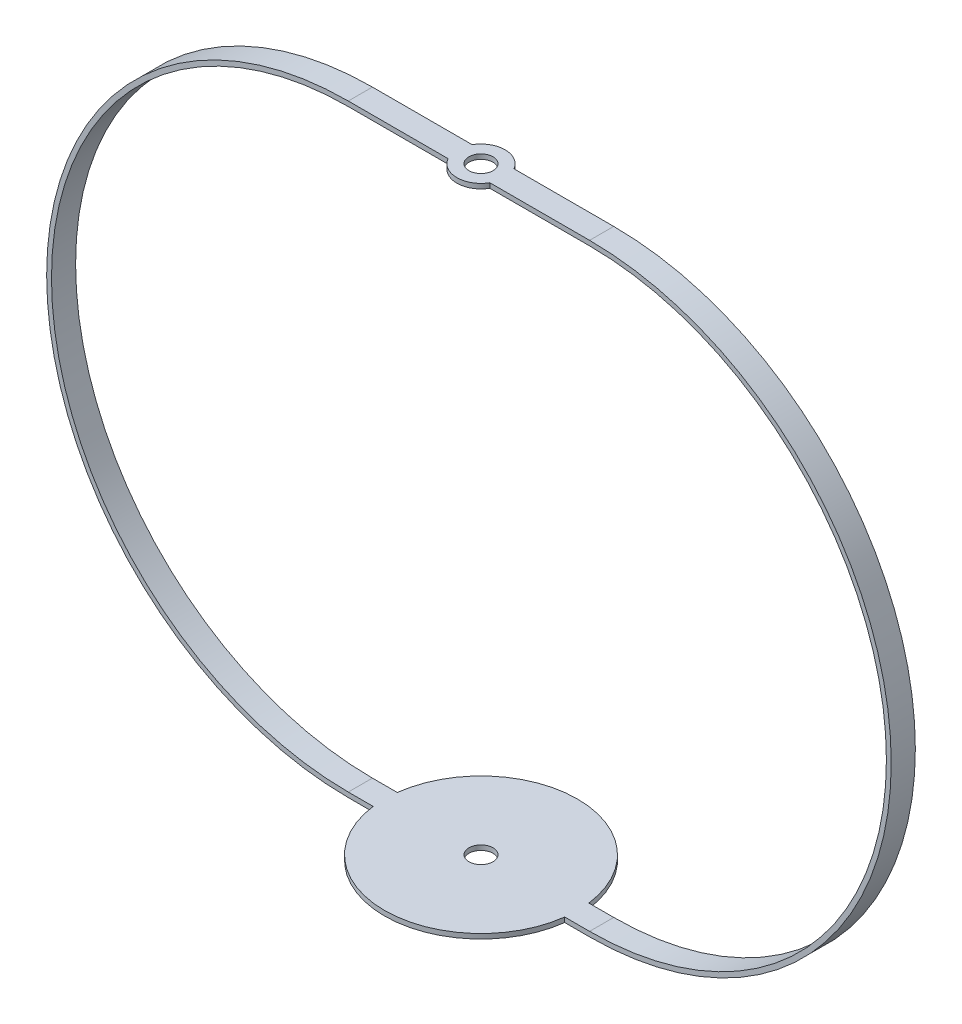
ISO-10303-21;
HEADER;
FILE_DESCRIPTION(('STEP AP214'),'2;1');
FILE_NAME('part.step','',(''),(''),'','','');
FILE_SCHEMA(('AUTOMOTIVE_DESIGN { 1 0 10303 214 1 1 1 1 }'));
ENDSEC;
DATA;
#1=APPLICATION_CONTEXT('core data for automotive mechanical design processes');
#2=APPLICATION_PROTOCOL_DEFINITION('international standard','automotive_design',2000,#1);
#3=PRODUCT_CONTEXT('',#1,'mechanical');
#4=PRODUCT('Part','Part','',(#3));
#5=PRODUCT_RELATED_PRODUCT_CATEGORY('part','',(#4));
#6=PRODUCT_DEFINITION_FORMATION('','',#4);
#7=PRODUCT_DEFINITION_CONTEXT('part definition',#1,'design');
#8=PRODUCT_DEFINITION('design','',#6,#7);
#9=PRODUCT_DEFINITION_SHAPE('','',#8);
#10=(LENGTH_UNIT() NAMED_UNIT(*) SI_UNIT(.MILLI.,.METRE.));
#11=(NAMED_UNIT(*) PLANE_ANGLE_UNIT() SI_UNIT($,.RADIAN.));
#12=(NAMED_UNIT(*) SI_UNIT($,.STERADIAN.) SOLID_ANGLE_UNIT());
#13=UNCERTAINTY_MEASURE_WITH_UNIT(LENGTH_MEASURE(1.E-05),#10,'distance_accuracy_value','');
#14=(GEOMETRIC_REPRESENTATION_CONTEXT(3) GLOBAL_UNCERTAINTY_ASSIGNED_CONTEXT((#13)) GLOBAL_UNIT_ASSIGNED_CONTEXT((#10,
#11,#12)) REPRESENTATION_CONTEXT('',''));
#15=CARTESIAN_POINT('',(0.,0.,0.));
#16=DIRECTION('',(0.,0.,1.));
#17=DIRECTION('',(1.,0.,0.));
#18=AXIS2_PLACEMENT_3D('',#15,#16,#17);
#19=CARTESIAN_POINT('',(0.,0.,5.));
#20=DIRECTION('',(0.,0.,1.));
#21=DIRECTION('',(1.,0.,0.));
#22=AXIS2_PLACEMENT_3D('',#19,#20,#21);
#23=PLANE('',#22);
#24=DIRECTION('',(0.,1.,0.));
#25=VECTOR('',#24,1.);
#26=CARTESIAN_POINT('',(84.6624945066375,0.,5.));
#27=LINE('',#26,#25);
#28=CARTESIAN_POINT('',(84.6624945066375,0.,5.));
#29=VERTEX_POINT('',#28);
#30=CARTESIAN_POINT('',(84.6624945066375,2.,5.));
#31=VERTEX_POINT('',#30);
#32=EDGE_CURVE('E243',#29,#31,#27,.T.);
#33=ORIENTED_EDGE('',*,*,#32,.F.);
#34=DIRECTION('',(1.,0.,0.));
#35=VECTOR('',#34,1.);
#36=CARTESIAN_POINT('',(0.,0.,5.));
#37=LINE('',#36,#35);
#38=CARTESIAN_POINT('',(94.9762248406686,0.,5.));
#39=VERTEX_POINT('',#38);
#40=EDGE_CURVE('E400',#29,#39,#37,.T.);
#41=ORIENTED_EDGE('',*,*,#40,.T.);
#42=CARTESIAN_POINT('',(94.9762248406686,125.,5.));
#43=DIRECTION('',(0.,0.,-1.));
#44=DIRECTION('',(-1.,0.,0.));
#45=AXIS2_PLACEMENT_3D('',#42,#43,#44);
#46=CIRCLE('',#45,125.);
#47=CARTESIAN_POINT('',(94.9762248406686,250.,5.));
#48=VERTEX_POINT('',#47);
#49=EDGE_CURVE('E419',#48,#39,#46,.T.);
#50=ORIENTED_EDGE('',*,*,#49,.F.);
#51=DIRECTION('',(1.,0.,0.));
#52=VECTOR('',#51,1.);
#53=CARTESIAN_POINT('',(0.,250.,5.));
#54=LINE('',#53,#52);
#55=CARTESIAN_POINT('',(53.636478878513,250.,5.));
#56=VERTEX_POINT('',#55);
#57=EDGE_CURVE('E445',#56,#48,#54,.T.);
#58=ORIENTED_EDGE('',*,*,#57,.F.);
#59=DIRECTION('',(0.,1.,0.));
#60=VECTOR('',#59,1.);
#61=CARTESIAN_POINT('',(53.636478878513,248.,5.));
#62=LINE('',#61,#60);
#63=CARTESIAN_POINT('',(53.636478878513,248.,5.));
#64=VERTEX_POINT('',#63);
#65=EDGE_CURVE('E401',#64,#56,#62,.T.);
#66=ORIENTED_EDGE('',*,*,#65,.F.);
#67=DIRECTION('',(-1.,0.,0.));
#68=VECTOR('',#67,1.);
#69=CARTESIAN_POINT('',(0.,248.,5.));
#70=LINE('',#69,#68);
#71=CARTESIAN_POINT('',(94.9762248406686,248.,5.));
#72=VERTEX_POINT('',#71);
#73=EDGE_CURVE('E442',#72,#64,#70,.T.);
#74=ORIENTED_EDGE('',*,*,#73,.F.);
#75=CARTESIAN_POINT('',(94.9762248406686,125.,5.));
#76=DIRECTION('',(0.,0.,-1.));
#77=DIRECTION('',(-1.,0.,0.));
#78=AXIS2_PLACEMENT_3D('',#75,#76,#77);
#79=CIRCLE('',#78,123.);
#80=CARTESIAN_POINT('',(94.9762248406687,2.,5.));
#81=VERTEX_POINT('',#80);
#82=EDGE_CURVE('E416',#72,#81,#79,.T.);
#83=ORIENTED_EDGE('',*,*,#82,.T.);
#84=DIRECTION('',(-1.,0.,0.));
#85=VECTOR('',#84,1.);
#86=CARTESIAN_POINT('',(0.,2.,5.));
#87=LINE('',#86,#85);
#88=EDGE_CURVE('E369',#81,#31,#87,.T.);
#89=ORIENTED_EDGE('',*,*,#88,.T.);
#90=EDGE_LOOP('',(#33,#41,#50,#58,#66,#74,#83,#89));
#91=FACE_BOUND('',#90,.T.);
#92=ADVANCED_FACE('F227',(#91),#23,.T.);
#93=CARTESIAN_POINT('',(0.,0.,-5.));
#94=DIRECTION('',(0.,0.,1.));
#95=DIRECTION('',(1.,0.,0.));
#96=AXIS2_PLACEMENT_3D('',#93,#94,#95);
#97=PLANE('',#96);
#98=DIRECTION('',(1.,0.,0.));
#99=VECTOR('',#98,1.);
#100=CARTESIAN_POINT('',(0.,0.,-5.));
#101=LINE('',#100,#99);
#102=CARTESIAN_POINT('',(84.6624945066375,0.,-5.));
#103=VERTEX_POINT('',#102);
#104=CARTESIAN_POINT('',(94.9762248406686,0.,-5.));
#105=VERTEX_POINT('',#104);
#106=EDGE_CURVE('E359',#103,#105,#101,.T.);
#107=ORIENTED_EDGE('',*,*,#106,.F.);
#108=DIRECTION('',(0.,1.,0.));
#109=VECTOR('',#108,1.);
#110=CARTESIAN_POINT('',(84.6624945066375,0.,-5.));
#111=LINE('',#110,#109);
#112=CARTESIAN_POINT('',(84.6624945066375,2.,-5.));
#113=VERTEX_POINT('',#112);
#114=EDGE_CURVE('E342',#103,#113,#111,.T.);
#115=ORIENTED_EDGE('',*,*,#114,.T.);
#116=DIRECTION('',(-1.,0.,0.));
#117=VECTOR('',#116,1.);
#118=CARTESIAN_POINT('',(0.,2.,-5.));
#119=LINE('',#118,#117);
#120=CARTESIAN_POINT('',(94.9762248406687,2.,-5.));
#121=VERTEX_POINT('',#120);
#122=EDGE_CURVE('E376',#121,#113,#119,.T.);
#123=ORIENTED_EDGE('',*,*,#122,.F.);
#124=CARTESIAN_POINT('',(94.9762248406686,125.,-5.));
#125=DIRECTION('',(0.,0.,-1.));
#126=DIRECTION('',(-1.,0.,0.));
#127=AXIS2_PLACEMENT_3D('',#124,#125,#126);
#128=CIRCLE('',#127,123.);
#129=CARTESIAN_POINT('',(94.9762248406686,248.,-5.));
#130=VERTEX_POINT('',#129);
#131=EDGE_CURVE('E378',#130,#121,#128,.T.);
#132=ORIENTED_EDGE('',*,*,#131,.F.);
#133=DIRECTION('',(-1.,0.,0.));
#134=VECTOR('',#133,1.);
#135=CARTESIAN_POINT('',(0.,248.,-5.));
#136=LINE('',#135,#134);
#137=CARTESIAN_POINT('',(53.636478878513,248.,-5.));
#138=VERTEX_POINT('',#137);
#139=EDGE_CURVE('E449',#130,#138,#136,.T.);
#140=ORIENTED_EDGE('',*,*,#139,.T.);
#141=DIRECTION('',(0.,1.,0.));
#142=VECTOR('',#141,1.);
#143=CARTESIAN_POINT('',(53.636478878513,248.,-5.));
#144=LINE('',#143,#142);
#145=CARTESIAN_POINT('',(53.636478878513,250.,-5.));
#146=VERTEX_POINT('',#145);
#147=EDGE_CURVE('E12',#138,#146,#144,.T.);
#148=ORIENTED_EDGE('',*,*,#147,.T.);
#149=DIRECTION('',(1.,0.,0.));
#150=VECTOR('',#149,1.);
#151=CARTESIAN_POINT('',(0.,250.,-5.));
#152=LINE('',#151,#150);
#153=CARTESIAN_POINT('',(94.9762248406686,250.,-5.));
#154=VERTEX_POINT('',#153);
#155=EDGE_CURVE('E450',#146,#154,#152,.T.);
#156=ORIENTED_EDGE('',*,*,#155,.T.);
#157=CARTESIAN_POINT('',(94.9762248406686,125.,-5.));
#158=DIRECTION('',(0.,0.,-1.));
#159=DIRECTION('',(-1.,0.,0.));
#160=AXIS2_PLACEMENT_3D('',#157,#158,#159);
#161=CIRCLE('',#160,125.);
#162=EDGE_CURVE('E368',#154,#105,#161,.T.);
#163=ORIENTED_EDGE('',*,*,#162,.T.);
#164=EDGE_LOOP('',(#107,#115,#123,#132,#140,#148,#156,#163));
#165=FACE_BOUND('',#164,.T.);
#166=ADVANCED_FACE('F366',(#165),#97,.F.);
#167=DIRECTION('',(0.,1.,0.));
#168=VECTOR('',#167,1.);
#169=CARTESIAN_POINT('',(5.28995517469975,0.,5.));
#170=LINE('',#169,#168);
#171=CARTESIAN_POINT('',(5.28995517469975,2.,5.));
#172=VERTEX_POINT('',#171);
#173=CARTESIAN_POINT('',(5.28995517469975,0.,5.));
#174=VERTEX_POINT('',#173);
#175=EDGE_CURVE('E353',#172,#174,#170,.F.);
#176=ORIENTED_EDGE('',*,*,#175,.F.);
#177=CARTESIAN_POINT('',(-5.0237751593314,2.,5.));
#178=VERTEX_POINT('',#177);
#179=EDGE_CURVE('E372',#172,#178,#87,.T.);
#180=ORIENTED_EDGE('',*,*,#179,.T.);
#181=CARTESIAN_POINT('',(-5.02377515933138,125.,5.));
#182=DIRECTION('',(0.,0.,1.));
#183=DIRECTION('',(1.,0.,0.));
#184=AXIS2_PLACEMENT_3D('',#181,#182,#183);
#185=CIRCLE('',#184,123.);
#186=CARTESIAN_POINT('',(-5.02377515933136,248.,5.));
#187=VERTEX_POINT('',#186);
#188=EDGE_CURVE('E432',#187,#178,#185,.T.);
#189=ORIENTED_EDGE('',*,*,#188,.F.);
#190=CARTESIAN_POINT('',(36.3159708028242,248.,5.));
#191=VERTEX_POINT('',#190);
#192=EDGE_CURVE('E439',#191,#187,#70,.T.);
#193=ORIENTED_EDGE('',*,*,#192,.F.);
#194=DIRECTION('',(0.,1.,0.));
#195=VECTOR('',#194,1.);
#196=CARTESIAN_POINT('',(36.3159708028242,248.,5.));
#197=LINE('',#196,#195);
#198=CARTESIAN_POINT('',(36.3159708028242,250.,5.));
#199=VERTEX_POINT('',#198);
#200=EDGE_CURVE('E404',#199,#191,#197,.F.);
#201=ORIENTED_EDGE('',*,*,#200,.F.);
#202=CARTESIAN_POINT('',(-5.02377515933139,250.,5.));
#203=VERTEX_POINT('',#202);
#204=EDGE_CURVE('E446',#203,#199,#54,.T.);
#205=ORIENTED_EDGE('',*,*,#204,.F.);
#206=CARTESIAN_POINT('',(-5.02377515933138,125.,5.));
#207=DIRECTION('',(0.,0.,1.));
#208=DIRECTION('',(1.,0.,0.));
#209=AXIS2_PLACEMENT_3D('',#206,#207,#208);
#210=CIRCLE('',#209,125.);
#211=CARTESIAN_POINT('',(-5.02377515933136,0.,5.));
#212=VERTEX_POINT('',#211);
#213=EDGE_CURVE('E434',#203,#212,#210,.T.);
#214=ORIENTED_EDGE('',*,*,#213,.T.);
#215=EDGE_CURVE('E251',#212,#174,#37,.T.);
#216=ORIENTED_EDGE('',*,*,#215,.T.);
#217=EDGE_LOOP('',(#176,#180,#189,#193,#201,#205,#214,#216));
#218=FACE_BOUND('',#217,.T.);
#219=ADVANCED_FACE('F466',(#218),#23,.T.);
#220=CARTESIAN_POINT('',(94.9762248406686,125.,5.));
#221=DIRECTION('',(0.,0.,-1.));
#222=DIRECTION('',(-1.,0.,0.));
#223=AXIS2_PLACEMENT_3D('',#220,#221,#222);
#224=CYLINDRICAL_SURFACE('',#223,123.);
#225=ORIENTED_EDGE('',*,*,#82,.F.);
#226=DIRECTION('',(0.,0.,1.));
#227=VECTOR('',#226,1.);
#228=CARTESIAN_POINT('',(94.9762248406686,248.,-5.));
#229=LINE('',#228,#227);
#230=EDGE_CURVE('E399',#130,#72,#229,.T.);
#231=ORIENTED_EDGE('',*,*,#230,.F.);
#232=ORIENTED_EDGE('',*,*,#131,.T.);
#233=DIRECTION('',(0.,0.,-1.));
#234=VECTOR('',#233,1.);
#235=CARTESIAN_POINT('',(94.9762248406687,2.,5.));
#236=LINE('',#235,#234);
#237=EDGE_CURVE('E424',#81,#121,#236,.T.);
#238=ORIENTED_EDGE('',*,*,#237,.F.);
#239=EDGE_LOOP('',(#225,#231,#232,#238));
#240=FACE_BOUND('',#239,.T.);
#241=ADVANCED_FACE('F492',(#240),#224,.F.);
#242=CARTESIAN_POINT('',(94.9762248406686,125.,5.));
#243=DIRECTION('',(0.,0.,-1.));
#244=DIRECTION('',(-1.,0.,0.));
#245=AXIS2_PLACEMENT_3D('',#242,#243,#244);
#246=CYLINDRICAL_SURFACE('',#245,125.);
#247=DIRECTION('',(0.,0.,-1.));
#248=VECTOR('',#247,1.);
#249=CARTESIAN_POINT('',(94.9762248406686,0.,5.));
#250=LINE('',#249,#248);
#251=EDGE_CURVE('E422',#39,#105,#250,.T.);
#252=ORIENTED_EDGE('',*,*,#251,.T.);
#253=ORIENTED_EDGE('',*,*,#162,.F.);
#254=DIRECTION('',(0.,0.,1.));
#255=VECTOR('',#254,1.);
#256=CARTESIAN_POINT('',(94.9762248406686,250.,-5.));
#257=LINE('',#256,#255);
#258=EDGE_CURVE('E391',#154,#48,#257,.T.);
#259=ORIENTED_EDGE('',*,*,#258,.T.);
#260=ORIENTED_EDGE('',*,*,#49,.T.);
#261=EDGE_LOOP('',(#252,#253,#259,#260));
#262=FACE_BOUND('',#261,.T.);
#263=ADVANCED_FACE('F495',(#262),#246,.T.);
#264=CARTESIAN_POINT('',(0.,250.,-5.));
#265=DIRECTION('',(0.,-1.,0.));
#266=DIRECTION('',(0.,0.,-1.));
#267=AXIS2_PLACEMENT_3D('',#264,#265,#266);
#268=PLANE('',#267);
#269=CARTESIAN_POINT('',(44.9762248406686,250.,0.));
#270=DIRECTION('',(0.,1.,0.));
#271=DIRECTION('',(0.,0.,1.));
#272=AXIS2_PLACEMENT_3D('',#269,#270,#271);
#273=CIRCLE('',#272,5.);
#274=CARTESIAN_POINT('',(44.9762248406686,250.,5.));
#275=VERTEX_POINT('',#274);
#276=EDGE_CURVE('E504',#275,#275,#273,.T.);
#277=ORIENTED_EDGE('',*,*,#276,.F.);
#278=EDGE_LOOP('',(#277));
#279=FACE_BOUND('',#278,.T.);
#280=ORIENTED_EDGE('',*,*,#204,.T.);
#281=CARTESIAN_POINT('',(44.9762248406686,250.,0.));
#282=DIRECTION('',(0.,1.,0.));
#283=DIRECTION('',(0.,0.,1.));
#284=AXIS2_PLACEMENT_3D('',#281,#282,#283);
#285=CIRCLE('',#284,10.);
#286=EDGE_CURVE('E479',#199,#56,#285,.T.);
#287=ORIENTED_EDGE('',*,*,#286,.T.);
#288=ORIENTED_EDGE('',*,*,#57,.T.);
#289=ORIENTED_EDGE('',*,*,#258,.F.);
#290=ORIENTED_EDGE('',*,*,#155,.F.);
#291=CARTESIAN_POINT('',(36.3159708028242,250.,-5.));
#292=VERTEX_POINT('',#291);
#293=EDGE_CURVE('E480',#146,#292,#285,.T.);
#294=ORIENTED_EDGE('',*,*,#293,.T.);
#295=CARTESIAN_POINT('',(-5.0237751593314,250.,-5.));
#296=VERTEX_POINT('',#295);
#297=EDGE_CURVE('E394',#296,#292,#152,.T.);
#298=ORIENTED_EDGE('',*,*,#297,.F.);
#299=DIRECTION('',(0.,0.,1.));
#300=VECTOR('',#299,1.);
#301=CARTESIAN_POINT('',(-5.02377515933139,250.,-5.));
#302=LINE('',#301,#300);
#303=EDGE_CURVE('E384',#296,#203,#302,.T.);
#304=ORIENTED_EDGE('',*,*,#303,.T.);
#305=EDGE_LOOP('',(#280,#287,#288,#289,#290,#294,#298,#304));
#306=FACE_BOUND('',#305,.T.);
#307=ADVANCED_FACE('F485',(#279,#306),#268,.F.);
#308=CARTESIAN_POINT('',(-5.02377515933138,125.,5.));
#309=DIRECTION('',(0.,0.,-1.));
#310=DIRECTION('',(-1.,0.,0.));
#311=AXIS2_PLACEMENT_3D('',#308,#309,#310);
#312=CYLINDRICAL_SURFACE('',#311,125.);
#313=ORIENTED_EDGE('',*,*,#213,.F.);
#314=ORIENTED_EDGE('',*,*,#303,.F.);
#315=CARTESIAN_POINT('',(-5.02377515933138,125.,-5.));
#316=DIRECTION('',(0.,0.,1.));
#317=DIRECTION('',(1.,0.,0.));
#318=AXIS2_PLACEMENT_3D('',#315,#316,#317);
#319=CIRCLE('',#318,125.);
#320=CARTESIAN_POINT('',(-5.02377515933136,0.,-5.));
#321=VERTEX_POINT('',#320);
#322=EDGE_CURVE('E429',#296,#321,#319,.T.);
#323=ORIENTED_EDGE('',*,*,#322,.T.);
#324=DIRECTION('',(0.,0.,-1.));
#325=VECTOR('',#324,1.);
#326=CARTESIAN_POINT('',(-5.02377515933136,0.,5.));
#327=LINE('',#326,#325);
#328=EDGE_CURVE('E437',#212,#321,#327,.T.);
#329=ORIENTED_EDGE('',*,*,#328,.F.);
#330=EDGE_LOOP('',(#313,#314,#323,#329));
#331=FACE_BOUND('',#330,.T.);
#332=ADVANCED_FACE('F543',(#331),#312,.T.);
#333=CARTESIAN_POINT('',(-5.02377515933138,125.,5.));
#334=DIRECTION('',(0.,0.,-1.));
#335=DIRECTION('',(-1.,0.,0.));
#336=AXIS2_PLACEMENT_3D('',#333,#334,#335);
#337=CYLINDRICAL_SURFACE('',#336,123.);
#338=DIRECTION('',(0.,0.,-1.));
#339=VECTOR('',#338,1.);
#340=CARTESIAN_POINT('',(-5.0237751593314,2.,5.));
#341=LINE('',#340,#339);
#342=CARTESIAN_POINT('',(-5.0237751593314,2.,-5.));
#343=VERTEX_POINT('',#342);
#344=EDGE_CURVE('E436',#178,#343,#341,.T.);
#345=ORIENTED_EDGE('',*,*,#344,.T.);
#346=CARTESIAN_POINT('',(-5.02377515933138,125.,-5.));
#347=DIRECTION('',(0.,0.,1.));
#348=DIRECTION('',(1.,0.,0.));
#349=AXIS2_PLACEMENT_3D('',#346,#347,#348);
#350=CIRCLE('',#349,123.);
#351=CARTESIAN_POINT('',(-5.02377515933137,248.,-5.));
#352=VERTEX_POINT('',#351);
#353=EDGE_CURVE('E426',#352,#343,#350,.T.);
#354=ORIENTED_EDGE('',*,*,#353,.F.);
#355=DIRECTION('',(0.,0.,1.));
#356=VECTOR('',#355,1.);
#357=CARTESIAN_POINT('',(-5.02377515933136,248.,-5.));
#358=LINE('',#357,#356);
#359=EDGE_CURVE('E379',#352,#187,#358,.T.);
#360=ORIENTED_EDGE('',*,*,#359,.T.);
#361=ORIENTED_EDGE('',*,*,#188,.T.);
#362=EDGE_LOOP('',(#345,#354,#360,#361));
#363=FACE_BOUND('',#362,.T.);
#364=ADVANCED_FACE('F459',(#363),#337,.F.);
#365=CARTESIAN_POINT('',(0.,248.,-5.));
#366=DIRECTION('',(0.,1.,0.));
#367=DIRECTION('',(0.,0.,1.));
#368=AXIS2_PLACEMENT_3D('',#365,#366,#367);
#369=PLANE('',#368);
#370=CARTESIAN_POINT('',(44.9762248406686,248.,0.));
#371=DIRECTION('',(0.,1.,0.));
#372=DIRECTION('',(0.,0.,1.));
#373=AXIS2_PLACEMENT_3D('',#370,#371,#372);
#374=CIRCLE('',#373,5.);
#375=CARTESIAN_POINT('',(44.9762248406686,248.,5.));
#376=VERTEX_POINT('',#375);
#377=EDGE_CURVE('E501',#376,#376,#374,.T.);
#378=ORIENTED_EDGE('',*,*,#377,.T.);
#379=EDGE_LOOP('',(#378));
#380=FACE_BOUND('',#379,.T.);
#381=CARTESIAN_POINT('',(36.3159708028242,248.,-5.));
#382=VERTEX_POINT('',#381);
#383=EDGE_CURVE('E448',#382,#352,#136,.T.);
#384=ORIENTED_EDGE('',*,*,#383,.F.);
#385=CARTESIAN_POINT('',(44.9762248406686,248.,0.));
#386=DIRECTION('',(0.,1.,0.));
#387=DIRECTION('',(0.,0.,1.));
#388=AXIS2_PLACEMENT_3D('',#385,#386,#387);
#389=CIRCLE('',#388,10.);
#390=EDGE_CURVE('E409',#138,#382,#389,.T.);
#391=ORIENTED_EDGE('',*,*,#390,.F.);
#392=ORIENTED_EDGE('',*,*,#139,.F.);
#393=ORIENTED_EDGE('',*,*,#230,.T.);
#394=ORIENTED_EDGE('',*,*,#73,.T.);
#395=EDGE_CURVE('E464',#191,#64,#389,.T.);
#396=ORIENTED_EDGE('',*,*,#395,.F.);
#397=ORIENTED_EDGE('',*,*,#192,.T.);
#398=ORIENTED_EDGE('',*,*,#359,.F.);
#399=EDGE_LOOP('',(#384,#391,#392,#393,#394,#396,#397,#398));
#400=FACE_BOUND('',#399,.T.);
#401=ADVANCED_FACE('F461',(#380,#400),#369,.F.);
#402=CARTESIAN_POINT('',(5.28995517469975,2.,-5.));
#403=VERTEX_POINT('',#402);
#404=EDGE_CURVE('E371',#403,#343,#119,.T.);
#405=ORIENTED_EDGE('',*,*,#404,.F.);
#406=DIRECTION('',(0.,1.,0.));
#407=VECTOR('',#406,1.);
#408=CARTESIAN_POINT('',(5.28995517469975,0.,-5.));
#409=LINE('',#408,#407);
#410=CARTESIAN_POINT('',(5.28995517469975,0.,-5.));
#411=VERTEX_POINT('',#410);
#412=EDGE_CURVE('E354',#403,#411,#409,.F.);
#413=ORIENTED_EDGE('',*,*,#412,.T.);
#414=EDGE_CURVE('E362',#321,#411,#101,.T.);
#415=ORIENTED_EDGE('',*,*,#414,.F.);
#416=ORIENTED_EDGE('',*,*,#322,.F.);
#417=ORIENTED_EDGE('',*,*,#297,.T.);
#418=DIRECTION('',(0.,1.,0.));
#419=VECTOR('',#418,1.);
#420=CARTESIAN_POINT('',(36.3159708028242,248.,-5.));
#421=LINE('',#420,#419);
#422=EDGE_CURVE('E236',#292,#382,#421,.F.);
#423=ORIENTED_EDGE('',*,*,#422,.T.);
#424=ORIENTED_EDGE('',*,*,#383,.T.);
#425=ORIENTED_EDGE('',*,*,#353,.T.);
#426=EDGE_LOOP('',(#405,#413,#415,#416,#417,#423,#424,#425));
#427=FACE_BOUND('',#426,.T.);
#428=ADVANCED_FACE('F455',(#427),#97,.F.);
#429=CARTESIAN_POINT('',(0.,0.,-5.));
#430=DIRECTION('',(0.,-1.,0.));
#431=DIRECTION('',(0.,0.,-1.));
#432=AXIS2_PLACEMENT_3D('',#429,#430,#431);
#433=PLANE('',#432);
#434=CARTESIAN_POINT('',(44.9762248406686,0.,0.));
#435=DIRECTION('',(0.,1.,0.));
#436=DIRECTION('',(0.,0.,1.));
#437=AXIS2_PLACEMENT_3D('',#434,#435,#436);
#438=CIRCLE('',#437,5.);
#439=CARTESIAN_POINT('',(44.9762248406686,0.,5.));
#440=VERTEX_POINT('',#439);
#441=EDGE_CURVE('E507',#440,#440,#438,.T.);
#442=ORIENTED_EDGE('',*,*,#441,.T.);
#443=EDGE_LOOP('',(#442));
#444=FACE_BOUND('',#443,.T.);
#445=ORIENTED_EDGE('',*,*,#414,.T.);
#446=CARTESIAN_POINT('',(44.9762248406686,0.,0.));
#447=DIRECTION('',(0.,1.,0.));
#448=DIRECTION('',(0.,0.,1.));
#449=AXIS2_PLACEMENT_3D('',#446,#447,#448);
#450=CIRCLE('',#449,40.);
#451=EDGE_CURVE('E346',#103,#411,#450,.T.);
#452=ORIENTED_EDGE('',*,*,#451,.F.);
#453=ORIENTED_EDGE('',*,*,#106,.T.);
#454=ORIENTED_EDGE('',*,*,#251,.F.);
#455=ORIENTED_EDGE('',*,*,#40,.F.);
#456=EDGE_CURVE('E363',#174,#29,#450,.T.);
#457=ORIENTED_EDGE('',*,*,#456,.F.);
#458=ORIENTED_EDGE('',*,*,#215,.F.);
#459=ORIENTED_EDGE('',*,*,#328,.T.);
#460=EDGE_LOOP('',(#445,#452,#453,#454,#455,#457,#458,#459));
#461=FACE_BOUND('',#460,.T.);
#462=ADVANCED_FACE('F229',(#444,#461),#433,.T.);
#463=CARTESIAN_POINT('',(0.,2.,-5.));
#464=DIRECTION('',(0.,1.,0.));
#465=DIRECTION('',(0.,0.,1.));
#466=AXIS2_PLACEMENT_3D('',#463,#464,#465);
#467=PLANE('',#466);
#468=CARTESIAN_POINT('',(44.9762248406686,2.,0.));
#469=DIRECTION('',(0.,1.,0.));
#470=DIRECTION('',(0.,0.,1.));
#471=AXIS2_PLACEMENT_3D('',#468,#469,#470);
#472=CIRCLE('',#471,5.);
#473=CARTESIAN_POINT('',(44.9762248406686,2.,5.));
#474=VERTEX_POINT('',#473);
#475=EDGE_CURVE('E231',#474,#474,#472,.T.);
#476=ORIENTED_EDGE('',*,*,#475,.F.);
#477=EDGE_LOOP('',(#476));
#478=FACE_BOUND('',#477,.T.);
#479=ORIENTED_EDGE('',*,*,#179,.F.);
#480=CARTESIAN_POINT('',(44.9762248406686,2.,0.));
#481=DIRECTION('',(0.,1.,0.));
#482=DIRECTION('',(0.,0.,1.));
#483=AXIS2_PLACEMENT_3D('',#480,#481,#482);
#484=CIRCLE('',#483,40.);
#485=EDGE_CURVE('E475',#172,#31,#484,.T.);
#486=ORIENTED_EDGE('',*,*,#485,.T.);
#487=ORIENTED_EDGE('',*,*,#88,.F.);
#488=ORIENTED_EDGE('',*,*,#237,.T.);
#489=ORIENTED_EDGE('',*,*,#122,.T.);
#490=EDGE_CURVE('E348',#113,#403,#484,.T.);
#491=ORIENTED_EDGE('',*,*,#490,.T.);
#492=ORIENTED_EDGE('',*,*,#404,.T.);
#493=ORIENTED_EDGE('',*,*,#344,.F.);
#494=EDGE_LOOP('',(#479,#486,#487,#488,#489,#491,#492,#493));
#495=FACE_BOUND('',#494,.T.);
#496=ADVANCED_FACE('F471',(#478,#495),#467,.T.);
#497=CARTESIAN_POINT('',(44.9762248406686,248.,0.));
#498=DIRECTION('',(0.,1.,0.));
#499=DIRECTION('',(0.,0.,1.));
#500=AXIS2_PLACEMENT_3D('',#497,#498,#499);
#501=CYLINDRICAL_SURFACE('',#500,10.);
#502=ORIENTED_EDGE('',*,*,#147,.F.);
#503=ORIENTED_EDGE('',*,*,#390,.T.);
#504=ORIENTED_EDGE('',*,*,#422,.F.);
#505=ORIENTED_EDGE('',*,*,#293,.F.);
#506=EDGE_LOOP('',(#502,#503,#504,#505));
#507=FACE_BOUND('',#506,.T.);
#508=ADVANCED_FACE('F488',(#507),#501,.T.);
#509=ORIENTED_EDGE('',*,*,#395,.T.);
#510=ORIENTED_EDGE('',*,*,#65,.T.);
#511=ORIENTED_EDGE('',*,*,#286,.F.);
#512=ORIENTED_EDGE('',*,*,#200,.T.);
#513=EDGE_LOOP('',(#509,#510,#511,#512));
#514=FACE_BOUND('',#513,.T.);
#515=ADVANCED_FACE('F522',(#514),#501,.T.);
#516=CARTESIAN_POINT('',(44.9762248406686,0.,0.));
#517=DIRECTION('',(0.,1.,0.));
#518=DIRECTION('',(0.,0.,1.));
#519=AXIS2_PLACEMENT_3D('',#516,#517,#518);
#520=CYLINDRICAL_SURFACE('',#519,40.);
#521=ORIENTED_EDGE('',*,*,#114,.F.);
#522=ORIENTED_EDGE('',*,*,#451,.T.);
#523=ORIENTED_EDGE('',*,*,#412,.F.);
#524=ORIENTED_EDGE('',*,*,#490,.F.);
#525=EDGE_LOOP('',(#521,#522,#523,#524));
#526=FACE_BOUND('',#525,.T.);
#527=ADVANCED_FACE('F344',(#526),#520,.T.);
#528=ORIENTED_EDGE('',*,*,#456,.T.);
#529=ORIENTED_EDGE('',*,*,#32,.T.);
#530=ORIENTED_EDGE('',*,*,#485,.F.);
#531=ORIENTED_EDGE('',*,*,#175,.T.);
#532=EDGE_LOOP('',(#528,#529,#530,#531));
#533=FACE_BOUND('',#532,.T.);
#534=ADVANCED_FACE('F499',(#533),#520,.T.);
#535=CARTESIAN_POINT('',(44.9762248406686,0.,0.));
#536=DIRECTION('',(0.,1.,0.));
#537=DIRECTION('',(0.,0.,1.));
#538=AXIS2_PLACEMENT_3D('',#535,#536,#537);
#539=CYLINDRICAL_SURFACE('',#538,5.);
#540=ORIENTED_EDGE('',*,*,#475,.T.);
#541=EDGE_LOOP('',(#540));
#542=FACE_BOUND('',#541,.T.);
#543=ORIENTED_EDGE('',*,*,#441,.F.);
#544=EDGE_LOOP('',(#543));
#545=FACE_BOUND('',#544,.T.);
#546=ADVANCED_FACE('F514',(#542,#545),#539,.F.);
#547=ORIENTED_EDGE('',*,*,#276,.T.);
#548=EDGE_LOOP('',(#547));
#549=FACE_BOUND('',#548,.T.);
#550=ORIENTED_EDGE('',*,*,#377,.F.);
#551=EDGE_LOOP('',(#550));
#552=FACE_BOUND('',#551,.T.);
#553=ADVANCED_FACE('F560',(#549,#552),#539,.F.);
#554=CLOSED_SHELL('',(#92,#166,#219,#241,#263,#307,#332,#364,#401,#428,#462,#496,#508,#515,#527,
#534,#546,#553));
#555=MANIFOLD_SOLID_BREP('B2',#554);
#556=ADVANCED_BREP_SHAPE_REPRESENTATION('',(#18,#555),#14);
#557=SHAPE_DEFINITION_REPRESENTATION(#9,#556);
ENDSEC;
END-ISO-10303-21;
